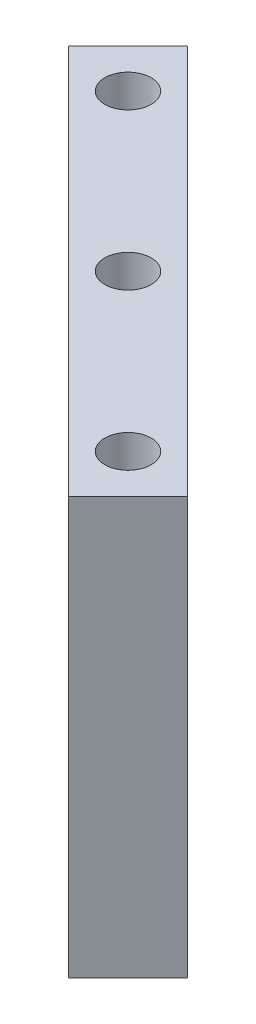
from build123d import *

# Parameters (mm, degrees)
SKETCH_1_R      = 2.1
EXTRUDE_1_DEPTH = 37.8


with BuildPart() as part:
    # Sketch 1 → Extrude 1 (new body)
    with BuildSketch(Plane(origin=(0, 0, 0), x_dir=(1, 0, 0), z_dir=(0, 1, 0))):
        Polygon((35.180959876, -40.554971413), (40.554971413, -35.180959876), (75.910310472, -70.536298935), (70.536298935, -75.910310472), align=None)
        with Locations(Location((41.40349955, -41.40349955, 0), (0, 0, 270))):
            Circle(SKETCH_1_R, mode=Mode.SUBTRACT)
        with Locations(Location((55.545635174, -55.545635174, 0), (0, 0, 270))):
            Circle(SKETCH_1_R, mode=Mode.SUBTRACT)
        with Locations(Location((69.687770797, -69.687770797, 0), (0, 0, 270))):
            Circle(SKETCH_1_R, mode=Mode.SUBTRACT)
    extrude(amount=EXTRUDE_1_DEPTH)


solid = part.part
